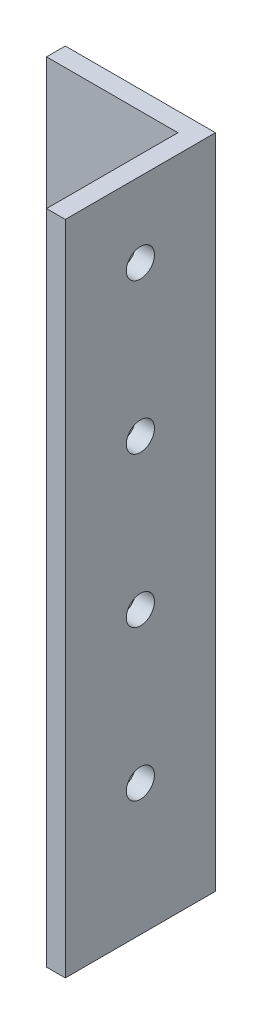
ISO-10303-21;
HEADER;
FILE_DESCRIPTION(('STEP AP214'),'2;1');
FILE_NAME('part.step','',(''),(''),'','','');
FILE_SCHEMA(('AUTOMOTIVE_DESIGN { 1 0 10303 214 1 1 1 1 }'));
ENDSEC;
DATA;
#1=APPLICATION_CONTEXT('core data for automotive mechanical design processes');
#2=APPLICATION_PROTOCOL_DEFINITION('international standard','automotive_design',2000,#1);
#3=PRODUCT_CONTEXT('',#1,'mechanical');
#4=PRODUCT('Part','Part','',(#3));
#5=PRODUCT_RELATED_PRODUCT_CATEGORY('part','',(#4));
#6=PRODUCT_DEFINITION_FORMATION('','',#4);
#7=PRODUCT_DEFINITION_CONTEXT('part definition',#1,'design');
#8=PRODUCT_DEFINITION('design','',#6,#7);
#9=PRODUCT_DEFINITION_SHAPE('','',#8);
#10=(LENGTH_UNIT() NAMED_UNIT(*) SI_UNIT(.MILLI.,.METRE.));
#11=(NAMED_UNIT(*) PLANE_ANGLE_UNIT() SI_UNIT($,.RADIAN.));
#12=(NAMED_UNIT(*) SI_UNIT($,.STERADIAN.) SOLID_ANGLE_UNIT());
#13=UNCERTAINTY_MEASURE_WITH_UNIT(LENGTH_MEASURE(1.E-05),#10,'distance_accuracy_value','');
#14=(GEOMETRIC_REPRESENTATION_CONTEXT(3) GLOBAL_UNCERTAINTY_ASSIGNED_CONTEXT((#13)) GLOBAL_UNIT_ASSIGNED_CONTEXT((#10,
#11,#12)) REPRESENTATION_CONTEXT('',''));
#15=CARTESIAN_POINT('',(0.,0.,0.));
#16=DIRECTION('',(0.,0.,1.));
#17=DIRECTION('',(1.,0.,0.));
#18=AXIS2_PLACEMENT_3D('',#15,#16,#17);
#19=CARTESIAN_POINT('',(12.7,111.10976,12.7));
#20=DIRECTION('',(-1.,0.,0.));
#21=DIRECTION('',(0.,0.,1.));
#22=AXIS2_PLACEMENT_3D('',#19,#20,#21);
#23=PLANE('',#22);
#24=CARTESIAN_POINT('',(12.7,73.00976,0.));
#25=DIRECTION('',(1.,0.,0.));
#26=DIRECTION('',(0.,0.,-1.));
#27=AXIS2_PLACEMENT_3D('',#24,#25,#26);
#28=CIRCLE('',#27,2.38125);
#29=CARTESIAN_POINT('',(12.7,73.00976,-2.38125));
#30=VERTEX_POINT('',#29);
#31=EDGE_CURVE('E214',#30,#30,#28,.T.);
#32=ORIENTED_EDGE('',*,*,#31,.F.);
#33=EDGE_LOOP('',(#32));
#34=FACE_BOUND('',#33,.T.);
#35=CARTESIAN_POINT('',(12.7,98.40976,0.));
#36=DIRECTION('',(1.,0.,0.));
#37=DIRECTION('',(0.,0.,-1.));
#38=AXIS2_PLACEMENT_3D('',#35,#36,#37);
#39=CIRCLE('',#38,2.38125);
#40=CARTESIAN_POINT('',(12.7,98.40976,-2.38125));
#41=VERTEX_POINT('',#40);
#42=EDGE_CURVE('E143',#41,#41,#39,.T.);
#43=ORIENTED_EDGE('',*,*,#42,.F.);
#44=EDGE_LOOP('',(#43));
#45=FACE_BOUND('',#44,.T.);
#46=DIRECTION('',(0.,0.,-1.));
#47=VECTOR('',#46,1.);
#48=CARTESIAN_POINT('',(12.7,0.,12.7));
#49=LINE('',#48,#47);
#50=CARTESIAN_POINT('',(12.7,0.,12.7));
#51=VERTEX_POINT('',#50);
#52=CARTESIAN_POINT('',(12.7,0.,-12.7));
#53=VERTEX_POINT('',#52);
#54=EDGE_CURVE('E119',#51,#53,#49,.T.);
#55=ORIENTED_EDGE('',*,*,#54,.T.);
#56=DIRECTION('',(0.,-1.,0.));
#57=VECTOR('',#56,1.);
#58=CARTESIAN_POINT('',(12.7,111.10976,-12.7));
#59=LINE('',#58,#57);
#60=CARTESIAN_POINT('',(12.7,111.10976,-12.7));
#61=VERTEX_POINT('',#60);
#62=EDGE_CURVE('E138',#61,#53,#59,.T.);
#63=ORIENTED_EDGE('',*,*,#62,.F.);
#64=DIRECTION('',(0.,0.,-1.));
#65=VECTOR('',#64,1.);
#66=CARTESIAN_POINT('',(12.7,111.10976,12.7));
#67=LINE('',#66,#65);
#68=CARTESIAN_POINT('',(12.7,111.10976,12.7));
#69=VERTEX_POINT('',#68);
#70=EDGE_CURVE('E131',#69,#61,#67,.T.);
#71=ORIENTED_EDGE('',*,*,#70,.F.);
#72=DIRECTION('',(0.,-1.,0.));
#73=VECTOR('',#72,1.);
#74=CARTESIAN_POINT('',(12.7,111.10976,12.7));
#75=LINE('',#74,#73);
#76=EDGE_CURVE('E115',#69,#51,#75,.T.);
#77=ORIENTED_EDGE('',*,*,#76,.T.);
#78=EDGE_LOOP('',(#55,#63,#71,#77));
#79=FACE_BOUND('',#78,.T.);
#80=CARTESIAN_POINT('',(12.7,47.60976,0.));
#81=DIRECTION('',(1.,0.,0.));
#82=DIRECTION('',(0.,0.,-1.));
#83=AXIS2_PLACEMENT_3D('',#80,#81,#82);
#84=CIRCLE('',#83,2.38125);
#85=CARTESIAN_POINT('',(12.7,47.60976,-2.38125));
#86=VERTEX_POINT('',#85);
#87=EDGE_CURVE('E140',#86,#86,#84,.T.);
#88=ORIENTED_EDGE('',*,*,#87,.F.);
#89=EDGE_LOOP('',(#88));
#90=FACE_BOUND('',#89,.T.);
#91=CARTESIAN_POINT('',(12.7,22.20976,0.));
#92=DIRECTION('',(1.,0.,0.));
#93=DIRECTION('',(0.,0.,-1.));
#94=AXIS2_PLACEMENT_3D('',#91,#92,#93);
#95=CIRCLE('',#94,2.38125);
#96=CARTESIAN_POINT('',(12.7,22.20976,-2.38125));
#97=VERTEX_POINT('',#96);
#98=EDGE_CURVE('E42',#97,#97,#95,.T.);
#99=ORIENTED_EDGE('',*,*,#98,.F.);
#100=EDGE_LOOP('',(#99));
#101=FACE_BOUND('',#100,.T.);
#102=ADVANCED_FACE('F33',(#34,#45,#79,#90,#101),#23,.F.);
#103=CARTESIAN_POINT('',(-12.7,111.10976,-12.7));
#104=DIRECTION('',(0.,0.,1.));
#105=DIRECTION('',(1.,0.,0.));
#106=AXIS2_PLACEMENT_3D('',#103,#104,#105);
#107=PLANE('',#106);
#108=DIRECTION('',(-1.,0.,0.));
#109=VECTOR('',#108,1.);
#110=CARTESIAN_POINT('',(-12.7,0.,-12.7));
#111=LINE('',#110,#109);
#112=CARTESIAN_POINT('',(-12.7,0.,-12.7));
#113=VERTEX_POINT('',#112);
#114=EDGE_CURVE('E122',#53,#113,#111,.T.);
#115=ORIENTED_EDGE('',*,*,#114,.T.);
#116=DIRECTION('',(0.,-1.,0.));
#117=VECTOR('',#116,1.);
#118=CARTESIAN_POINT('',(-12.7,111.10976,-12.7));
#119=LINE('',#118,#117);
#120=CARTESIAN_POINT('',(-12.7,111.10976,-12.7));
#121=VERTEX_POINT('',#120);
#122=EDGE_CURVE('E135',#121,#113,#119,.T.);
#123=ORIENTED_EDGE('',*,*,#122,.F.);
#124=DIRECTION('',(-1.,0.,0.));
#125=VECTOR('',#124,1.);
#126=CARTESIAN_POINT('',(-12.7,111.10976,-12.7));
#127=LINE('',#126,#125);
#128=EDGE_CURVE('E87',#61,#121,#127,.T.);
#129=ORIENTED_EDGE('',*,*,#128,.F.);
#130=ORIENTED_EDGE('',*,*,#62,.T.);
#131=EDGE_LOOP('',(#115,#123,#129,#130));
#132=FACE_BOUND('',#131,.T.);
#133=ADVANCED_FACE('F154',(#132),#107,.F.);
#134=CARTESIAN_POINT('',(-12.7,111.10976,-9.52499999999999));
#135=DIRECTION('',(1.,0.,0.));
#136=DIRECTION('',(0.,0.,-1.));
#137=AXIS2_PLACEMENT_3D('',#134,#135,#136);
#138=PLANE('',#137);
#139=DIRECTION('',(0.,0.,1.));
#140=VECTOR('',#139,1.);
#141=CARTESIAN_POINT('',(-12.7,0.,-9.52499999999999));
#142=LINE('',#141,#140);
#143=CARTESIAN_POINT('',(-12.7,0.,-9.52499999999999));
#144=VERTEX_POINT('',#143);
#145=EDGE_CURVE('E125',#113,#144,#142,.T.);
#146=ORIENTED_EDGE('',*,*,#145,.T.);
#147=DIRECTION('',(0.,-1.,0.));
#148=VECTOR('',#147,1.);
#149=CARTESIAN_POINT('',(-12.7,111.10976,-9.52499999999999));
#150=LINE('',#149,#148);
#151=CARTESIAN_POINT('',(-12.7,111.10976,-9.52499999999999));
#152=VERTEX_POINT('',#151);
#153=EDGE_CURVE('E109',#152,#144,#150,.T.);
#154=ORIENTED_EDGE('',*,*,#153,.F.);
#155=DIRECTION('',(0.,0.,1.));
#156=VECTOR('',#155,1.);
#157=CARTESIAN_POINT('',(-12.7,111.10976,-9.52499999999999));
#158=LINE('',#157,#156);
#159=EDGE_CURVE('E100',#121,#152,#158,.T.);
#160=ORIENTED_EDGE('',*,*,#159,.F.);
#161=ORIENTED_EDGE('',*,*,#122,.T.);
#162=EDGE_LOOP('',(#146,#154,#160,#161));
#163=FACE_BOUND('',#162,.T.);
#164=ADVANCED_FACE('F162',(#163),#138,.F.);
#165=CARTESIAN_POINT('',(-9.525,111.10976,-9.52499999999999));
#166=DIRECTION('',(0.,0.,-1.));
#167=DIRECTION('',(-1.,0.,0.));
#168=AXIS2_PLACEMENT_3D('',#165,#166,#167);
#169=PLANE('',#168);
#170=DIRECTION('',(1.,0.,0.));
#171=VECTOR('',#170,1.);
#172=CARTESIAN_POINT('',(-9.525,0.,-9.52499999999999));
#173=LINE('',#172,#171);
#174=CARTESIAN_POINT('',(9.525,0.,-9.52499999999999));
#175=VERTEX_POINT('',#174);
#176=EDGE_CURVE('E108',#144,#175,#173,.T.);
#177=ORIENTED_EDGE('',*,*,#176,.T.);
#178=DIRECTION('',(0.,-1.,0.));
#179=VECTOR('',#178,1.);
#180=CARTESIAN_POINT('',(9.525,111.10976,-9.52499999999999));
#181=LINE('',#180,#179);
#182=CARTESIAN_POINT('',(9.525,111.10976,-9.52499999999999));
#183=VERTEX_POINT('',#182);
#184=EDGE_CURVE('E106',#183,#175,#181,.T.);
#185=ORIENTED_EDGE('',*,*,#184,.F.);
#186=DIRECTION('',(1.,0.,0.));
#187=VECTOR('',#186,1.);
#188=CARTESIAN_POINT('',(-9.525,111.10976,-9.52499999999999));
#189=LINE('',#188,#187);
#190=EDGE_CURVE('E94',#152,#183,#189,.T.);
#191=ORIENTED_EDGE('',*,*,#190,.F.);
#192=ORIENTED_EDGE('',*,*,#153,.T.);
#193=EDGE_LOOP('',(#177,#185,#191,#192));
#194=FACE_BOUND('',#193,.T.);
#195=ADVANCED_FACE('F107',(#194),#169,.F.);
#196=CARTESIAN_POINT('',(9.525,111.10976,9.52500000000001));
#197=DIRECTION('',(1.,0.,0.));
#198=DIRECTION('',(0.,0.,-1.));
#199=AXIS2_PLACEMENT_3D('',#196,#197,#198);
#200=PLANE('',#199);
#201=CARTESIAN_POINT('',(9.525,73.00976,0.));
#202=DIRECTION('',(1.,0.,0.));
#203=DIRECTION('',(0.,0.,-1.));
#204=AXIS2_PLACEMENT_3D('',#201,#202,#203);
#205=CIRCLE('',#204,2.38125);
#206=CARTESIAN_POINT('',(9.525,73.00976,-2.38125));
#207=VERTEX_POINT('',#206);
#208=EDGE_CURVE('E212',#207,#207,#205,.T.);
#209=ORIENTED_EDGE('',*,*,#208,.T.);
#210=EDGE_LOOP('',(#209));
#211=FACE_BOUND('',#210,.T.);
#212=CARTESIAN_POINT('',(9.525,98.40976,0.));
#213=DIRECTION('',(1.,0.,0.));
#214=DIRECTION('',(0.,0.,-1.));
#215=AXIS2_PLACEMENT_3D('',#212,#213,#214);
#216=CIRCLE('',#215,2.38125);
#217=CARTESIAN_POINT('',(9.525,98.40976,-2.38125));
#218=VERTEX_POINT('',#217);
#219=EDGE_CURVE('E123',#218,#218,#216,.T.);
#220=ORIENTED_EDGE('',*,*,#219,.T.);
#221=EDGE_LOOP('',(#220));
#222=FACE_BOUND('',#221,.T.);
#223=DIRECTION('',(0.,0.,1.));
#224=VECTOR('',#223,1.);
#225=CARTESIAN_POINT('',(9.525,0.,9.52500000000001));
#226=LINE('',#225,#224);
#227=CARTESIAN_POINT('',(9.525,0.,12.7));
#228=VERTEX_POINT('',#227);
#229=EDGE_CURVE('E72',#175,#228,#226,.T.);
#230=ORIENTED_EDGE('',*,*,#229,.T.);
#231=DIRECTION('',(0.,-1.,0.));
#232=VECTOR('',#231,1.);
#233=CARTESIAN_POINT('',(9.525,111.10976,12.7));
#234=LINE('',#233,#232);
#235=CARTESIAN_POINT('',(9.525,111.10976,12.7));
#236=VERTEX_POINT('',#235);
#237=EDGE_CURVE('E110',#236,#228,#234,.T.);
#238=ORIENTED_EDGE('',*,*,#237,.F.);
#239=DIRECTION('',(0.,0.,1.));
#240=VECTOR('',#239,1.);
#241=CARTESIAN_POINT('',(9.525,111.10976,9.52500000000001));
#242=LINE('',#241,#240);
#243=EDGE_CURVE('E98',#183,#236,#242,.T.);
#244=ORIENTED_EDGE('',*,*,#243,.F.);
#245=ORIENTED_EDGE('',*,*,#184,.T.);
#246=EDGE_LOOP('',(#230,#238,#244,#245));
#247=FACE_BOUND('',#246,.T.);
#248=CARTESIAN_POINT('',(9.525,47.60976,0.));
#249=DIRECTION('',(1.,0.,0.));
#250=DIRECTION('',(0.,0.,-1.));
#251=AXIS2_PLACEMENT_3D('',#248,#249,#250);
#252=CIRCLE('',#251,2.38125);
#253=CARTESIAN_POINT('',(9.525,47.60976,-2.38125));
#254=VERTEX_POINT('',#253);
#255=EDGE_CURVE('E146',#254,#254,#252,.T.);
#256=ORIENTED_EDGE('',*,*,#255,.T.);
#257=EDGE_LOOP('',(#256));
#258=FACE_BOUND('',#257,.T.);
#259=CARTESIAN_POINT('',(9.525,22.20976,0.));
#260=DIRECTION('',(1.,0.,0.));
#261=DIRECTION('',(0.,0.,-1.));
#262=AXIS2_PLACEMENT_3D('',#259,#260,#261);
#263=CIRCLE('',#262,2.38125);
#264=CARTESIAN_POINT('',(9.525,22.20976,-2.38125));
#265=VERTEX_POINT('',#264);
#266=EDGE_CURVE('E11',#265,#265,#263,.T.);
#267=ORIENTED_EDGE('',*,*,#266,.T.);
#268=EDGE_LOOP('',(#267));
#269=FACE_BOUND('',#268,.T.);
#270=ADVANCED_FACE('F112',(#211,#222,#247,#258,#269),#200,.F.);
#271=CARTESIAN_POINT('',(9.525,111.10976,12.7));
#272=DIRECTION('',(0.,0.,-1.));
#273=DIRECTION('',(-1.,0.,0.));
#274=AXIS2_PLACEMENT_3D('',#271,#272,#273);
#275=PLANE('',#274);
#276=DIRECTION('',(1.,0.,0.));
#277=VECTOR('',#276,1.);
#278=CARTESIAN_POINT('',(9.525,0.,12.7));
#279=LINE('',#278,#277);
#280=EDGE_CURVE('E78',#228,#51,#279,.T.);
#281=ORIENTED_EDGE('',*,*,#280,.T.);
#282=ORIENTED_EDGE('',*,*,#76,.F.);
#283=DIRECTION('',(1.,0.,0.));
#284=VECTOR('',#283,1.);
#285=CARTESIAN_POINT('',(9.525,111.10976,12.7));
#286=LINE('',#285,#284);
#287=EDGE_CURVE('E50',#236,#69,#286,.T.);
#288=ORIENTED_EDGE('',*,*,#287,.F.);
#289=ORIENTED_EDGE('',*,*,#237,.T.);
#290=EDGE_LOOP('',(#281,#282,#288,#289));
#291=FACE_BOUND('',#290,.T.);
#292=ADVANCED_FACE('F182',(#291),#275,.F.);
#293=CARTESIAN_POINT('',(0.,111.10976,0.));
#294=DIRECTION('',(0.,-1.,0.));
#295=DIRECTION('',(0.,0.,-1.));
#296=AXIS2_PLACEMENT_3D('',#293,#294,#295);
#297=PLANE('',#296);
#298=ORIENTED_EDGE('',*,*,#70,.T.);
#299=ORIENTED_EDGE('',*,*,#128,.T.);
#300=ORIENTED_EDGE('',*,*,#159,.T.);
#301=ORIENTED_EDGE('',*,*,#190,.T.);
#302=ORIENTED_EDGE('',*,*,#243,.T.);
#303=ORIENTED_EDGE('',*,*,#287,.T.);
#304=EDGE_LOOP('',(#298,#299,#300,#301,#302,#303));
#305=FACE_BOUND('',#304,.T.);
#306=ADVANCED_FACE('F96',(#305),#297,.F.);
#307=CARTESIAN_POINT('',(0.,0.,0.));
#308=DIRECTION('',(0.,-1.,0.));
#309=DIRECTION('',(0.,0.,-1.));
#310=AXIS2_PLACEMENT_3D('',#307,#308,#309);
#311=PLANE('',#310);
#312=ORIENTED_EDGE('',*,*,#54,.F.);
#313=ORIENTED_EDGE('',*,*,#280,.F.);
#314=ORIENTED_EDGE('',*,*,#229,.F.);
#315=ORIENTED_EDGE('',*,*,#176,.F.);
#316=ORIENTED_EDGE('',*,*,#145,.F.);
#317=ORIENTED_EDGE('',*,*,#114,.F.);
#318=EDGE_LOOP('',(#312,#313,#314,#315,#316,#317));
#319=FACE_BOUND('',#318,.T.);
#320=ADVANCED_FACE('F202',(#319),#311,.T.);
#321=CARTESIAN_POINT('',(-12.7,98.40976,0.));
#322=DIRECTION('',(1.,0.,0.));
#323=DIRECTION('',(0.,0.,-1.));
#324=AXIS2_PLACEMENT_3D('',#321,#322,#323);
#325=CYLINDRICAL_SURFACE('',#324,2.38125);
#326=ORIENTED_EDGE('',*,*,#42,.T.);
#327=EDGE_LOOP('',(#326));
#328=FACE_BOUND('',#327,.T.);
#329=ORIENTED_EDGE('',*,*,#219,.F.);
#330=EDGE_LOOP('',(#329));
#331=FACE_BOUND('',#330,.T.);
#332=ADVANCED_FACE('F175',(#328,#331),#325,.F.);
#333=CARTESIAN_POINT('',(-12.7,73.00976,0.));
#334=DIRECTION('',(1.,0.,0.));
#335=DIRECTION('',(0.,0.,-1.));
#336=AXIS2_PLACEMENT_3D('',#333,#334,#335);
#337=CYLINDRICAL_SURFACE('',#336,2.38125);
#338=ORIENTED_EDGE('',*,*,#31,.T.);
#339=EDGE_LOOP('',(#338));
#340=FACE_BOUND('',#339,.T.);
#341=ORIENTED_EDGE('',*,*,#208,.F.);
#342=EDGE_LOOP('',(#341));
#343=FACE_BOUND('',#342,.T.);
#344=ADVANCED_FACE('F169',(#340,#343),#337,.F.);
#345=CARTESIAN_POINT('',(-12.7,47.60976,0.));
#346=DIRECTION('',(1.,0.,0.));
#347=DIRECTION('',(0.,0.,-1.));
#348=AXIS2_PLACEMENT_3D('',#345,#346,#347);
#349=CYLINDRICAL_SURFACE('',#348,2.38125);
#350=ORIENTED_EDGE('',*,*,#87,.T.);
#351=EDGE_LOOP('',(#350));
#352=FACE_BOUND('',#351,.T.);
#353=ORIENTED_EDGE('',*,*,#255,.F.);
#354=EDGE_LOOP('',(#353));
#355=FACE_BOUND('',#354,.T.);
#356=ADVANCED_FACE('F167',(#352,#355),#349,.F.);
#357=CARTESIAN_POINT('',(-12.7,22.20976,0.));
#358=DIRECTION('',(1.,0.,0.));
#359=DIRECTION('',(0.,0.,-1.));
#360=AXIS2_PLACEMENT_3D('',#357,#358,#359);
#361=CYLINDRICAL_SURFACE('',#360,2.38125);
#362=ORIENTED_EDGE('',*,*,#98,.T.);
#363=EDGE_LOOP('',(#362));
#364=FACE_BOUND('',#363,.T.);
#365=ORIENTED_EDGE('',*,*,#266,.F.);
#366=EDGE_LOOP('',(#365));
#367=FACE_BOUND('',#366,.T.);
#368=ADVANCED_FACE('F35',(#364,#367),#361,.F.);
#369=CLOSED_SHELL('',(#102,#133,#164,#195,#270,#292,#306,#320,#332,#344,#356,#368));
#370=MANIFOLD_SOLID_BREP('B2',#369);
#371=ADVANCED_BREP_SHAPE_REPRESENTATION('',(#18,#370),#14);
#372=SHAPE_DEFINITION_REPRESENTATION(#9,#371);
ENDSEC;
END-ISO-10303-21;
